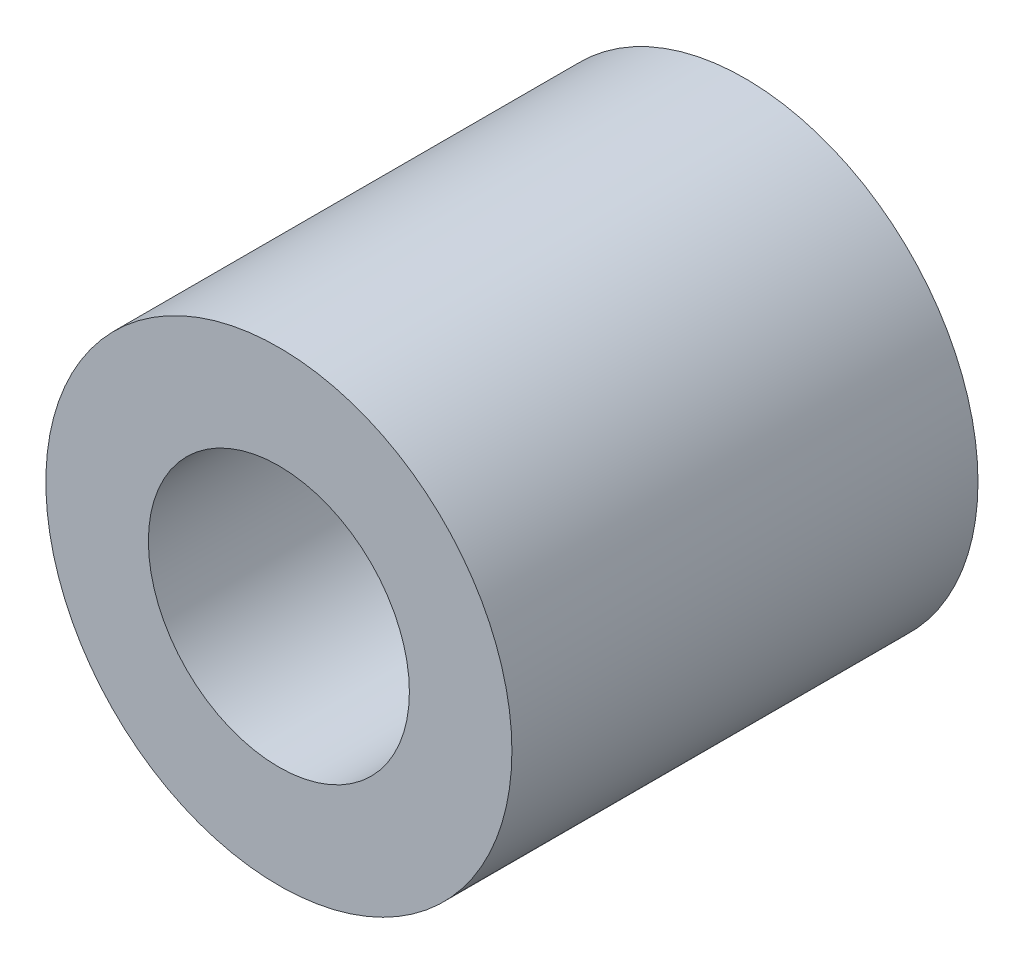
ISO-10303-21;
HEADER;
FILE_DESCRIPTION(('STEP AP214'),'2;1');
FILE_NAME('part.step','',(''),(''),'','','');
FILE_SCHEMA(('AUTOMOTIVE_DESIGN { 1 0 10303 214 1 1 1 1 }'));
ENDSEC;
DATA;
#1=APPLICATION_CONTEXT('core data for automotive mechanical design processes');
#2=APPLICATION_PROTOCOL_DEFINITION('international standard','automotive_design',2000,#1);
#3=PRODUCT_CONTEXT('',#1,'mechanical');
#4=PRODUCT('Part','Part','',(#3));
#5=PRODUCT_RELATED_PRODUCT_CATEGORY('part','',(#4));
#6=PRODUCT_DEFINITION_FORMATION('','',#4);
#7=PRODUCT_DEFINITION_CONTEXT('part definition',#1,'design');
#8=PRODUCT_DEFINITION('design','',#6,#7);
#9=PRODUCT_DEFINITION_SHAPE('','',#8);
#10=(LENGTH_UNIT() NAMED_UNIT(*) SI_UNIT(.MILLI.,.METRE.));
#11=(NAMED_UNIT(*) PLANE_ANGLE_UNIT() SI_UNIT($,.RADIAN.));
#12=(NAMED_UNIT(*) SI_UNIT($,.STERADIAN.) SOLID_ANGLE_UNIT());
#13=UNCERTAINTY_MEASURE_WITH_UNIT(LENGTH_MEASURE(1.E-05),#10,'distance_accuracy_value','');
#14=(GEOMETRIC_REPRESENTATION_CONTEXT(3) GLOBAL_UNCERTAINTY_ASSIGNED_CONTEXT((#13)) GLOBAL_UNIT_ASSIGNED_CONTEXT((#10,
#11,#12)) REPRESENTATION_CONTEXT('',''));
#15=CARTESIAN_POINT('',(0.,0.,0.));
#16=DIRECTION('',(0.,0.,1.));
#17=DIRECTION('',(1.,0.,0.));
#18=AXIS2_PLACEMENT_3D('',#15,#16,#17);
#19=CARTESIAN_POINT('',(7.,0.,7.));
#20=DIRECTION('',(0.,0.,-1.));
#21=DIRECTION('',(-1.,0.,0.));
#22=AXIS2_PLACEMENT_3D('',#19,#20,#21);
#23=PLANE('',#22);
#24=CARTESIAN_POINT('',(0.,0.,7.));
#25=DIRECTION('',(0.,0.,1.));
#26=DIRECTION('',(1.,0.,0.));
#27=AXIS2_PLACEMENT_3D('',#24,#25,#26);
#28=CIRCLE('',#27,4.5);
#29=CARTESIAN_POINT('',(4.5,0.,7.));
#30=VERTEX_POINT('',#29);
#31=EDGE_CURVE('E8',#30,#30,#28,.T.);
#32=ORIENTED_EDGE('',*,*,#31,.F.);
#33=EDGE_LOOP('',(#32));
#34=FACE_BOUND('',#33,.T.);
#35=CARTESIAN_POINT('',(0.,0.,7.));
#36=DIRECTION('',(0.,0.,1.));
#37=DIRECTION('',(1.,0.,0.));
#38=AXIS2_PLACEMENT_3D('',#35,#36,#37);
#39=CIRCLE('',#38,7.);
#40=CARTESIAN_POINT('',(7.,0.,7.));
#41=VERTEX_POINT('',#40);
#42=EDGE_CURVE('E34',#41,#41,#39,.T.);
#43=ORIENTED_EDGE('',*,*,#42,.T.);
#44=EDGE_LOOP('',(#43));
#45=FACE_BOUND('',#44,.T.);
#46=ADVANCED_FACE('F12',(#34,#45),#23,.F.);
#47=CARTESIAN_POINT('',(0.,0.,40.));
#48=DIRECTION('',(0.,0.,1.));
#49=DIRECTION('',(1.,0.,0.));
#50=AXIS2_PLACEMENT_3D('',#47,#48,#49);
#51=CYLINDRICAL_SURFACE('',#50,4.5);
#52=CARTESIAN_POINT('',(0.,0.,0.));
#53=DIRECTION('',(0.,0.,1.));
#54=DIRECTION('',(1.,0.,0.));
#55=AXIS2_PLACEMENT_3D('',#52,#53,#54);
#56=CIRCLE('',#55,4.5);
#57=CARTESIAN_POINT('',(4.5,0.,0.));
#58=VERTEX_POINT('',#57);
#59=EDGE_CURVE('E18',#58,#58,#56,.T.);
#60=ORIENTED_EDGE('',*,*,#59,.F.);
#61=EDGE_LOOP('',(#60));
#62=FACE_BOUND('',#61,.T.);
#63=ORIENTED_EDGE('',*,*,#31,.T.);
#64=EDGE_LOOP('',(#63));
#65=FACE_BOUND('',#64,.T.);
#66=ADVANCED_FACE('F59',(#62,#65),#51,.F.);
#67=CARTESIAN_POINT('',(4.5,0.,0.));
#68=DIRECTION('',(0.,0.,1.));
#69=DIRECTION('',(1.,0.,0.));
#70=AXIS2_PLACEMENT_3D('',#67,#68,#69);
#71=PLANE('',#70);
#72=CARTESIAN_POINT('',(0.,0.,0.));
#73=DIRECTION('',(0.,0.,1.));
#74=DIRECTION('',(1.,0.,0.));
#75=AXIS2_PLACEMENT_3D('',#72,#73,#74);
#76=CIRCLE('',#75,12.5);
#77=CARTESIAN_POINT('',(12.5,0.,0.));
#78=VERTEX_POINT('',#77);
#79=EDGE_CURVE('E22',#78,#78,#76,.T.);
#80=ORIENTED_EDGE('',*,*,#79,.F.);
#81=EDGE_LOOP('',(#80));
#82=FACE_BOUND('',#81,.T.);
#83=ORIENTED_EDGE('',*,*,#59,.T.);
#84=EDGE_LOOP('',(#83));
#85=FACE_BOUND('',#84,.T.);
#86=ADVANCED_FACE('F54',(#82,#85),#71,.F.);
#87=CARTESIAN_POINT('',(0.,0.,40.));
#88=DIRECTION('',(0.,0.,1.));
#89=DIRECTION('',(1.,0.,0.));
#90=AXIS2_PLACEMENT_3D('',#87,#88,#89);
#91=CYLINDRICAL_SURFACE('',#90,12.5);
#92=CARTESIAN_POINT('',(0.,0.,25.));
#93=DIRECTION('',(0.,0.,1.));
#94=DIRECTION('',(1.,0.,0.));
#95=AXIS2_PLACEMENT_3D('',#92,#93,#94);
#96=CIRCLE('',#95,12.5);
#97=CARTESIAN_POINT('',(12.5,0.,25.));
#98=VERTEX_POINT('',#97);
#99=EDGE_CURVE('E26',#98,#98,#96,.T.);
#100=ORIENTED_EDGE('',*,*,#99,.F.);
#101=EDGE_LOOP('',(#100));
#102=FACE_BOUND('',#101,.T.);
#103=ORIENTED_EDGE('',*,*,#79,.T.);
#104=EDGE_LOOP('',(#103));
#105=FACE_BOUND('',#104,.T.);
#106=ADVANCED_FACE('F48',(#102,#105),#91,.T.);
#107=CARTESIAN_POINT('',(12.5,0.,25.));
#108=DIRECTION('',(0.,0.,-1.));
#109=DIRECTION('',(-1.,0.,0.));
#110=AXIS2_PLACEMENT_3D('',#107,#108,#109);
#111=PLANE('',#110);
#112=CARTESIAN_POINT('',(0.,0.,25.));
#113=DIRECTION('',(0.,0.,1.));
#114=DIRECTION('',(1.,0.,0.));
#115=AXIS2_PLACEMENT_3D('',#112,#113,#114);
#116=CIRCLE('',#115,7.);
#117=CARTESIAN_POINT('',(7.,0.,25.));
#118=VERTEX_POINT('',#117);
#119=EDGE_CURVE('E31',#118,#118,#116,.T.);
#120=ORIENTED_EDGE('',*,*,#119,.F.);
#121=EDGE_LOOP('',(#120));
#122=FACE_BOUND('',#121,.T.);
#123=ORIENTED_EDGE('',*,*,#99,.T.);
#124=EDGE_LOOP('',(#123));
#125=FACE_BOUND('',#124,.T.);
#126=ADVANCED_FACE('F42',(#122,#125),#111,.F.);
#127=CARTESIAN_POINT('',(0.,0.,40.));
#128=DIRECTION('',(0.,0.,1.));
#129=DIRECTION('',(1.,0.,0.));
#130=AXIS2_PLACEMENT_3D('',#127,#128,#129);
#131=CYLINDRICAL_SURFACE('',#130,7.);
#132=ORIENTED_EDGE('',*,*,#42,.F.);
#133=EDGE_LOOP('',(#132));
#134=FACE_BOUND('',#133,.T.);
#135=ORIENTED_EDGE('',*,*,#119,.T.);
#136=EDGE_LOOP('',(#135));
#137=FACE_BOUND('',#136,.T.);
#138=ADVANCED_FACE('F39',(#134,#137),#131,.F.);
#139=CLOSED_SHELL('',(#46,#66,#86,#106,#126,#138));
#140=MANIFOLD_SOLID_BREP('B1',#139);
#141=ADVANCED_BREP_SHAPE_REPRESENTATION('',(#18,#140),#14);
#142=SHAPE_DEFINITION_REPRESENTATION(#9,#141);
ENDSEC;
END-ISO-10303-21;
